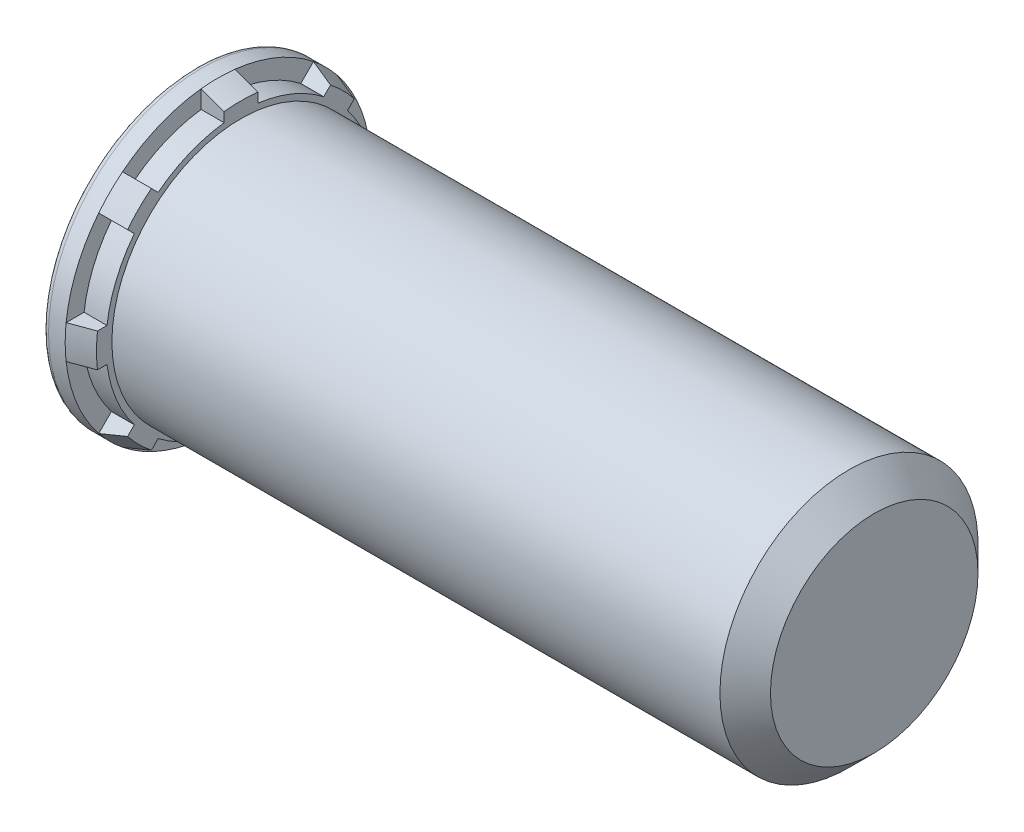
ISO-10303-21;
HEADER;
FILE_DESCRIPTION(('STEP AP214'),'2;1');
FILE_NAME('part.step','',(''),(''),'','','');
FILE_SCHEMA(('AUTOMOTIVE_DESIGN { 1 0 10303 214 1 1 1 1 }'));
ENDSEC;
DATA;
#1=APPLICATION_CONTEXT('core data for automotive mechanical design processes');
#2=APPLICATION_PROTOCOL_DEFINITION('international standard','automotive_design',2000,#1);
#3=PRODUCT_CONTEXT('',#1,'mechanical');
#4=PRODUCT('Part','Part','',(#3));
#5=PRODUCT_RELATED_PRODUCT_CATEGORY('part','',(#4));
#6=PRODUCT_DEFINITION_FORMATION('','',#4);
#7=PRODUCT_DEFINITION_CONTEXT('part definition',#1,'design');
#8=PRODUCT_DEFINITION('design','',#6,#7);
#9=PRODUCT_DEFINITION_SHAPE('','',#8);
#10=(LENGTH_UNIT() NAMED_UNIT(*) SI_UNIT(.MILLI.,.METRE.));
#11=(NAMED_UNIT(*) PLANE_ANGLE_UNIT() SI_UNIT($,.RADIAN.));
#12=(NAMED_UNIT(*) SI_UNIT($,.STERADIAN.) SOLID_ANGLE_UNIT());
#13=UNCERTAINTY_MEASURE_WITH_UNIT(LENGTH_MEASURE(1.E-05),#10,'distance_accuracy_value','');
#14=(GEOMETRIC_REPRESENTATION_CONTEXT(3) GLOBAL_UNCERTAINTY_ASSIGNED_CONTEXT((#13)) GLOBAL_UNIT_ASSIGNED_CONTEXT((#10,
#11,#12)) REPRESENTATION_CONTEXT('',''));
#15=CARTESIAN_POINT('',(0.,0.,0.));
#16=DIRECTION('',(0.,0.,1.));
#17=DIRECTION('',(1.,0.,0.));
#18=AXIS2_PLACEMENT_3D('',#15,#16,#17);
#19=CARTESIAN_POINT('',(0.,0.,0.));
#20=DIRECTION('',(-1.,0.,0.));
#21=DIRECTION('',(0.,0.,1.));
#22=AXIS2_PLACEMENT_3D('',#19,#20,#21);
#23=CONICAL_SURFACE('',#22,2.8575,0.349065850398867);
#24=CARTESIAN_POINT('',(0.428824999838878,1.67445523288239,2.11987551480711));
#25=CARTESIAN_POINT('',(0.357323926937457,1.69298332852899,2.13840361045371));
#26=CARTESIAN_POINT('',(0.285821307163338,1.71150843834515,2.15692872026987));
#27=CARTESIAN_POINT('',(0.142812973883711,1.74855268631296,2.19397296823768));
#28=CARTESIAN_POINT('',(0.0713072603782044,1.76707182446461,2.21249210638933));
#29=CARTESIAN_POINT('',(-0.000199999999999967,1.78558797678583,2.23100825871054));
#30=B_SPLINE_CURVE_WITH_KNOTS('',3,(#24,#25,#26,#27,#28,#29),.UNSPECIFIED.,.F.,.F.,(4,2,4),(0.,
0.228453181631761,0.456906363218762),.UNSPECIFIED.);
#31=CARTESIAN_POINT('',(0.428624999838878,1.67450705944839,2.11992734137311));
#32=VERTEX_POINT('',#31);
#33=CARTESIAN_POINT('',(0.,1.7855361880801,2.23095647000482));
#34=VERTEX_POINT('',#33);
#35=EDGE_CURVE('E271',#32,#34,#30,.T.);
#36=ORIENTED_EDGE('',*,*,#35,.F.);
#37=CARTESIAN_POINT('',(0.428625,0.,0.));
#38=DIRECTION('',(-1.,0.,0.));
#39=DIRECTION('',(0.,0.,1.));
#40=AXIS2_PLACEMENT_3D('',#37,#38,#39);
#41=CIRCLE('',#40,2.70149325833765);
#42=CARTESIAN_POINT('',(0.428624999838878,2.1199273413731,1.6745070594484));
#43=VERTEX_POINT('',#42);
#44=EDGE_CURVE('E322',#32,#43,#41,.T.);
#45=ORIENTED_EDGE('',*,*,#44,.T.);
#46=CARTESIAN_POINT('',(-0.000200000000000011,2.23100825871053,1.78558797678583));
#47=CARTESIAN_POINT('',(0.0713072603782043,2.21249210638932,1.76707182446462));
#48=CARTESIAN_POINT('',(0.142812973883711,2.19397296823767,1.74855268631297));
#49=CARTESIAN_POINT('',(0.285821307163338,2.15692872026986,1.71150843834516));
#50=CARTESIAN_POINT('',(0.357323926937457,2.1384036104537,1.692983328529));
#51=CARTESIAN_POINT('',(0.428824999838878,2.1198755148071,1.6744552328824));
#52=B_SPLINE_CURVE_WITH_KNOTS('',3,(#46,#47,#48,#49,#50,#51),.UNSPECIFIED.,.F.,.F.,(4,2,4),(0.,
0.228453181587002,0.456906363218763),.UNSPECIFIED.);
#53=CARTESIAN_POINT('',(-1.61121550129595E-10,2.23095647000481,1.78553618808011));
#54=VERTEX_POINT('',#53);
#55=EDGE_CURVE('E496',#54,#43,#52,.T.);
#56=ORIENTED_EDGE('',*,*,#55,.F.);
#57=CARTESIAN_POINT('',(0.,0.,0.));
#58=DIRECTION('',(-1.,0.,0.));
#59=DIRECTION('',(0.,0.,1.));
#60=AXIS2_PLACEMENT_3D('',#57,#58,#59);
#61=CIRCLE('',#60,2.8575);
#62=EDGE_CURVE('E280',#34,#54,#61,.T.);
#63=ORIENTED_EDGE('',*,*,#62,.F.);
#64=EDGE_LOOP('',(#36,#45,#56,#63));
#65=FACE_BOUND('',#64,.T.);
#66=ADVANCED_FACE('F33',(#65),#23,.T.);
#67=CARTESIAN_POINT('',(-0.890575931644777,0.314959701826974,3.1660153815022));
#68=CARTESIAN_POINT('',(-0.568904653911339,0.314959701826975,3.04837944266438));
#69=CARTESIAN_POINT('',(-0.247263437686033,0.314959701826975,2.93066143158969));
#70=CARTESIAN_POINT('',(0.395958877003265,0.314959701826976,2.69506126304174));
#71=CARTESIAN_POINT('',(0.717539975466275,0.314959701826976,2.5771791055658));
#72=CARTESIAN_POINT('',(1.03909101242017,0.314959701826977,2.4592148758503));
#73=B_SPLINE_CURVE_WITH_KNOTS('',3,(#67,#68,#69,#70,#71,#72),.UNSPECIFIED.,.F.,.F.,(4,2,4),(0.,
1.02751906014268,2.05503813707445),.UNSPECIFIED.);
#74=CARTESIAN_POINT('',(-1.61121550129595E-10,0.314959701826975,2.84008919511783));
#75=VERTEX_POINT('',#74);
#76=CARTESIAN_POINT('',(0.428624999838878,0.314959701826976,2.6830702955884));
#77=VERTEX_POINT('',#76);
#78=EDGE_CURVE('E248',#75,#77,#73,.T.);
#79=ORIENTED_EDGE('',*,*,#78,.F.);
#80=CARTESIAN_POINT('',(0.,-0.314959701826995,2.84008919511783));
#81=VERTEX_POINT('',#80);
#82=EDGE_CURVE('E267',#81,#75,#61,.T.);
#83=ORIENTED_EDGE('',*,*,#82,.F.);
#84=CARTESIAN_POINT('',(1.03909101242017,-0.314959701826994,2.4592148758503));
#85=CARTESIAN_POINT('',(0.717539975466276,-0.314959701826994,2.5771791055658));
#86=CARTESIAN_POINT('',(0.395958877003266,-0.314959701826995,2.69506126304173));
#87=CARTESIAN_POINT('',(-0.247263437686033,-0.314959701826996,2.93066143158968));
#88=CARTESIAN_POINT('',(-0.568904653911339,-0.314959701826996,3.04837944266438));
#89=CARTESIAN_POINT('',(-0.890575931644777,-0.314959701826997,3.16601538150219));
#90=B_SPLINE_CURVE_WITH_KNOTS('',3,(#84,#85,#86,#87,#88,#89),.UNSPECIFIED.,.F.,.F.,(4,2,4),(0.,
1.02751907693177,2.05503813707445),.UNSPECIFIED.);
#91=CARTESIAN_POINT('',(0.428624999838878,-0.314959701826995,2.6830702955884));
#92=VERTEX_POINT('',#91);
#93=EDGE_CURVE('E272',#92,#81,#90,.T.);
#94=ORIENTED_EDGE('',*,*,#93,.F.);
#95=EDGE_CURVE('E270',#92,#77,#41,.T.);
#96=ORIENTED_EDGE('',*,*,#95,.T.);
#97=EDGE_LOOP('',(#79,#83,#94,#96));
#98=FACE_BOUND('',#97,.T.);
#99=ADVANCED_FACE('F265',(#98),#23,.T.);
#100=CARTESIAN_POINT('',(-0.000200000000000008,-1.78558797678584,2.23100825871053));
#101=CARTESIAN_POINT('',(0.0713072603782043,-1.76707182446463,2.21249210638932));
#102=CARTESIAN_POINT('',(0.142812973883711,-1.74855268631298,2.19397296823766));
#103=CARTESIAN_POINT('',(0.285821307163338,-1.71150843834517,2.15692872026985));
#104=CARTESIAN_POINT('',(0.357323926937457,-1.69298332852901,2.1384036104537));
#105=CARTESIAN_POINT('',(0.428824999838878,-1.67445523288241,2.1198755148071));
#106=B_SPLINE_CURVE_WITH_KNOTS('',3,(#100,#101,#102,#103,#104,#105),.UNSPECIFIED.,.F.,.F.,(4,2,
4),(0.,0.228453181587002,0.456906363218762),.UNSPECIFIED.);
#107=CARTESIAN_POINT('',(-1.61121550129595E-10,-1.78553618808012,2.23095647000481));
#108=VERTEX_POINT('',#107);
#109=CARTESIAN_POINT('',(0.428624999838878,-1.67450705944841,2.1199273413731));
#110=VERTEX_POINT('',#109);
#111=EDGE_CURVE('E340',#108,#110,#106,.T.);
#112=ORIENTED_EDGE('',*,*,#111,.F.);
#113=CARTESIAN_POINT('',(0.,-2.23095647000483,1.7855361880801));
#114=VERTEX_POINT('',#113);
#115=EDGE_CURVE('E279',#114,#108,#61,.T.);
#116=ORIENTED_EDGE('',*,*,#115,.F.);
#117=CARTESIAN_POINT('',(0.428824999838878,-2.11987551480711,1.67445523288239));
#118=CARTESIAN_POINT('',(0.357323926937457,-2.13840361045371,1.69298332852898));
#119=CARTESIAN_POINT('',(0.285821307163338,-2.15692872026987,1.71150843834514));
#120=CARTESIAN_POINT('',(0.142812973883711,-2.19397296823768,1.74855268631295));
#121=CARTESIAN_POINT('',(0.0713072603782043,-2.21249210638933,1.7670718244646));
#122=CARTESIAN_POINT('',(-0.000199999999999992,-2.23100825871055,1.78558797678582));
#123=B_SPLINE_CURVE_WITH_KNOTS('',3,(#117,#118,#119,#120,#121,#122),.UNSPECIFIED.,.F.,.F.,(4,2,
4),(0.,0.228453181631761,0.456906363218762),.UNSPECIFIED.);
#124=CARTESIAN_POINT('',(0.428624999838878,-2.11992734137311,1.67450705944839));
#125=VERTEX_POINT('',#124);
#126=EDGE_CURVE('E611',#125,#114,#123,.T.);
#127=ORIENTED_EDGE('',*,*,#126,.F.);
#128=EDGE_CURVE('E585',#125,#110,#41,.T.);
#129=ORIENTED_EDGE('',*,*,#128,.T.);
#130=EDGE_LOOP('',(#112,#116,#127,#129));
#131=FACE_BOUND('',#130,.T.);
#132=ADVANCED_FACE('F573',(#131),#23,.T.);
#133=CARTESIAN_POINT('',(-0.890575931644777,-3.1660153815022,0.314959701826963));
#134=CARTESIAN_POINT('',(-0.568904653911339,-3.04837944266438,0.314959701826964));
#135=CARTESIAN_POINT('',(-0.247263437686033,-2.93066143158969,0.314959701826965));
#136=CARTESIAN_POINT('',(0.395958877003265,-2.69506126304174,0.314959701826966));
#137=CARTESIAN_POINT('',(0.717539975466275,-2.5771791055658,0.314959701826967));
#138=CARTESIAN_POINT('',(1.03909101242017,-2.4592148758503,0.314959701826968));
#139=B_SPLINE_CURVE_WITH_KNOTS('',3,(#133,#134,#135,#136,#137,#138),.UNSPECIFIED.,.F.,.F.,(4,2,
4),(0.,1.02751906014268,2.05503813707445),.UNSPECIFIED.);
#140=CARTESIAN_POINT('',(-1.61121550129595E-10,-2.84008919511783,0.314959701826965));
#141=VERTEX_POINT('',#140);
#142=CARTESIAN_POINT('',(0.428624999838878,-2.6830702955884,0.314959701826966));
#143=VERTEX_POINT('',#142);
#144=EDGE_CURVE('E623',#141,#143,#139,.T.);
#145=ORIENTED_EDGE('',*,*,#144,.F.);
#146=CARTESIAN_POINT('',(0.,-2.84008919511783,-0.314959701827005));
#147=VERTEX_POINT('',#146);
#148=EDGE_CURVE('E282',#147,#141,#61,.T.);
#149=ORIENTED_EDGE('',*,*,#148,.F.);
#150=CARTESIAN_POINT('',(1.03909101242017,-2.4592148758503,-0.314959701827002));
#151=CARTESIAN_POINT('',(0.717539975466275,-2.5771791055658,-0.314959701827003));
#152=CARTESIAN_POINT('',(0.395958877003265,-2.69506126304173,-0.314959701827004));
#153=CARTESIAN_POINT('',(-0.247263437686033,-2.93066143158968,-0.314959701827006));
#154=CARTESIAN_POINT('',(-0.56890465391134,-3.04837944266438,-0.314959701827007));
#155=CARTESIAN_POINT('',(-0.890575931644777,-3.16601538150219,-0.314959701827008));
#156=B_SPLINE_CURVE_WITH_KNOTS('',3,(#150,#151,#152,#153,#154,#155),.UNSPECIFIED.,.F.,.F.,(4,2,
4),(0.,1.02751907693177,2.05503813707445),.UNSPECIFIED.);
#157=CARTESIAN_POINT('',(0.428624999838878,-2.6830702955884,-0.314959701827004));
#158=VERTEX_POINT('',#157);
#159=EDGE_CURVE('E631',#158,#147,#156,.T.);
#160=ORIENTED_EDGE('',*,*,#159,.F.);
#161=EDGE_CURVE('E597',#158,#143,#41,.T.);
#162=ORIENTED_EDGE('',*,*,#161,.T.);
#163=EDGE_LOOP('',(#145,#149,#160,#162));
#164=FACE_BOUND('',#163,.T.);
#165=ADVANCED_FACE('F633',(#164),#23,.T.);
#166=CARTESIAN_POINT('',(-0.000200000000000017,-2.23100825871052,-1.78558797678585));
#167=CARTESIAN_POINT('',(0.0713072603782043,-2.21249210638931,-1.76707182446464));
#168=CARTESIAN_POINT('',(0.142812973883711,-2.19397296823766,-1.74855268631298));
#169=CARTESIAN_POINT('',(0.285821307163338,-2.15692872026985,-1.71150843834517));
#170=CARTESIAN_POINT('',(0.357323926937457,-2.13840361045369,-1.69298332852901));
#171=CARTESIAN_POINT('',(0.428824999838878,-2.11987551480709,-1.67445523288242));
#172=B_SPLINE_CURVE_WITH_KNOTS('',3,(#166,#167,#168,#169,#170,#171),.UNSPECIFIED.,.F.,.F.,(4,2,
4),(0.,0.228453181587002,0.456906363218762),.UNSPECIFIED.);
#173=CARTESIAN_POINT('',(-1.61121550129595E-10,-2.2309564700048,-1.78553618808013));
#174=VERTEX_POINT('',#173);
#175=CARTESIAN_POINT('',(0.428624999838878,-2.11992734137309,-1.67450705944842));
#176=VERTEX_POINT('',#175);
#177=EDGE_CURVE('E636',#174,#176,#172,.T.);
#178=ORIENTED_EDGE('',*,*,#177,.F.);
#179=CARTESIAN_POINT('',(0.,-1.78553618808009,-2.23095647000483));
#180=VERTEX_POINT('',#179);
#181=EDGE_CURVE('E715',#180,#174,#61,.T.);
#182=ORIENTED_EDGE('',*,*,#181,.F.);
#183=CARTESIAN_POINT('',(0.428824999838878,-1.67445523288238,-2.11987551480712));
#184=CARTESIAN_POINT('',(0.357323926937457,-1.69298332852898,-2.13840361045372));
#185=CARTESIAN_POINT('',(0.285821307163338,-1.71150843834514,-2.15692872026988));
#186=CARTESIAN_POINT('',(0.142812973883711,-1.74855268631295,-2.19397296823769));
#187=CARTESIAN_POINT('',(0.0713072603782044,-1.7670718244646,-2.21249210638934));
#188=CARTESIAN_POINT('',(-0.000199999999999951,-1.78558797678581,-2.23100825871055));
#189=B_SPLINE_CURVE_WITH_KNOTS('',3,(#183,#184,#185,#186,#187,#188),.UNSPECIFIED.,.F.,.F.,(4,2,
4),(0.,0.228453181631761,0.456906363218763),.UNSPECIFIED.);
#190=CARTESIAN_POINT('',(0.428624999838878,-1.67450705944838,-2.11992734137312));
#191=VERTEX_POINT('',#190);
#192=EDGE_CURVE('E639',#191,#180,#189,.T.);
#193=ORIENTED_EDGE('',*,*,#192,.F.);
#194=EDGE_CURVE('E591',#191,#176,#41,.T.);
#195=ORIENTED_EDGE('',*,*,#194,.T.);
#196=EDGE_LOOP('',(#178,#182,#193,#195));
#197=FACE_BOUND('',#196,.T.);
#198=ADVANCED_FACE('F1029',(#197),#23,.T.);
#199=CARTESIAN_POINT('',(-0.890575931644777,-0.314959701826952,-3.1660153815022));
#200=CARTESIAN_POINT('',(-0.568904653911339,-0.314959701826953,-3.04837944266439));
#201=CARTESIAN_POINT('',(-0.247263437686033,-0.314959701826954,-2.93066143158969));
#202=CARTESIAN_POINT('',(0.395958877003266,-0.314959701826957,-2.69506126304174));
#203=CARTESIAN_POINT('',(0.717539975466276,-0.314959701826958,-2.5771791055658));
#204=CARTESIAN_POINT('',(1.03909101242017,-0.314959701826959,-2.4592148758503));
#205=B_SPLINE_CURVE_WITH_KNOTS('',3,(#199,#200,#201,#202,#203,#204),.UNSPECIFIED.,.F.,.F.,(4,2,
4),(0.,1.02751906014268,2.05503813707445),.UNSPECIFIED.);
#206=CARTESIAN_POINT('',(-1.61121550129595E-10,-0.314959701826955,-2.84008919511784));
#207=VERTEX_POINT('',#206);
#208=CARTESIAN_POINT('',(0.428624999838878,-0.314959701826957,-2.6830702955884));
#209=VERTEX_POINT('',#208);
#210=EDGE_CURVE('E688',#207,#209,#205,.T.);
#211=ORIENTED_EDGE('',*,*,#210,.F.);
#212=CARTESIAN_POINT('',(0.,0.314959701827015,-2.84008919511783));
#213=VERTEX_POINT('',#212);
#214=EDGE_CURVE('E711',#213,#207,#61,.T.);
#215=ORIENTED_EDGE('',*,*,#214,.F.);
#216=CARTESIAN_POINT('',(1.03909101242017,0.314959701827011,-2.45921487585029));
#217=CARTESIAN_POINT('',(0.717539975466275,0.314959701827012,-2.5771791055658));
#218=CARTESIAN_POINT('',(0.395958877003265,0.314959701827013,-2.69506126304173));
#219=CARTESIAN_POINT('',(-0.247263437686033,0.314959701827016,-2.93066143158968));
#220=CARTESIAN_POINT('',(-0.568904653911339,0.314959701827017,-3.04837944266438));
#221=CARTESIAN_POINT('',(-0.890575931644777,0.314959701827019,-3.16601538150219));
#222=B_SPLINE_CURVE_WITH_KNOTS('',3,(#216,#217,#218,#219,#220,#221),.UNSPECIFIED.,.F.,.F.,(4,2,
4),(0.,1.02751907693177,2.05503813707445),.UNSPECIFIED.);
#223=CARTESIAN_POINT('',(0.428624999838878,0.314959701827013,-2.6830702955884));
#224=VERTEX_POINT('',#223);
#225=EDGE_CURVE('E456',#224,#213,#222,.T.);
#226=ORIENTED_EDGE('',*,*,#225,.F.);
#227=EDGE_CURVE('E321',#224,#209,#41,.T.);
#228=ORIENTED_EDGE('',*,*,#227,.T.);
#229=EDGE_LOOP('',(#211,#215,#226,#228));
#230=FACE_BOUND('',#229,.T.);
#231=ADVANCED_FACE('F713',(#230),#23,.T.);
#232=CARTESIAN_POINT('',(1.03909101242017,2.4592148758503,0.314959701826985));
#233=CARTESIAN_POINT('',(0.717539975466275,2.5771791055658,0.314959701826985));
#234=CARTESIAN_POINT('',(0.395958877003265,2.69506126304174,0.314959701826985));
#235=CARTESIAN_POINT('',(-0.247263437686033,2.93066143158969,0.314959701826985));
#236=CARTESIAN_POINT('',(-0.568904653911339,3.04837944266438,0.314959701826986));
#237=CARTESIAN_POINT('',(-0.890575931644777,3.16601538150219,0.314959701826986));
#238=B_SPLINE_CURVE_WITH_KNOTS('',3,(#232,#233,#234,#235,#236,#237),.UNSPECIFIED.,.F.,.F.,(4,2,
4),(0.,1.02751907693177,2.05503813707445),.UNSPECIFIED.);
#239=CARTESIAN_POINT('',(0.428624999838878,2.6830702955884,0.314959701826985));
#240=VERTEX_POINT('',#239);
#241=CARTESIAN_POINT('',(0.,2.84008919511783,0.314959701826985));
#242=VERTEX_POINT('',#241);
#243=EDGE_CURVE('E487',#240,#242,#238,.T.);
#244=ORIENTED_EDGE('',*,*,#243,.F.);
#245=CARTESIAN_POINT('',(0.428624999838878,2.6830702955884,-0.314959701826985));
#246=VERTEX_POINT('',#245);
#247=EDGE_CURVE('E316',#240,#246,#41,.T.);
#248=ORIENTED_EDGE('',*,*,#247,.T.);
#249=CARTESIAN_POINT('',(-0.890575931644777,3.16601538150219,-0.314959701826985));
#250=CARTESIAN_POINT('',(-0.568904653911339,3.04837944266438,-0.314959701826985));
#251=CARTESIAN_POINT('',(-0.247263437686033,2.93066143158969,-0.314959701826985));
#252=CARTESIAN_POINT('',(0.395958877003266,2.69506126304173,-0.314959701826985));
#253=CARTESIAN_POINT('',(0.717539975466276,2.5771791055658,-0.314959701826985));
#254=CARTESIAN_POINT('',(1.03909101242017,2.4592148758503,-0.314959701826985));
#255=B_SPLINE_CURVE_WITH_KNOTS('',3,(#249,#250,#251,#252,#253,#254),.UNSPECIFIED.,.F.,.F.,(4,2,
4),(0.,1.02751906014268,2.05503813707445),.UNSPECIFIED.);
#256=CARTESIAN_POINT('',(-1.61121550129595E-10,2.84008919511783,-0.314959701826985));
#257=VERTEX_POINT('',#256);
#258=EDGE_CURVE('E517',#257,#246,#255,.T.);
#259=ORIENTED_EDGE('',*,*,#258,.F.);
#260=EDGE_CURVE('E283',#242,#257,#61,.T.);
#261=ORIENTED_EDGE('',*,*,#260,.F.);
#262=EDGE_LOOP('',(#244,#248,#259,#261));
#263=FACE_BOUND('',#262,.T.);
#264=ADVANCED_FACE('F566',(#263),#23,.T.);
#265=CARTESIAN_POINT('',(-0.000200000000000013,1.78558797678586,-2.23100825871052));
#266=CARTESIAN_POINT('',(0.0713072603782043,1.76707182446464,-2.2124921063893));
#267=CARTESIAN_POINT('',(0.142812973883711,1.74855268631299,-2.19397296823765));
#268=CARTESIAN_POINT('',(0.285821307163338,1.71150843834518,-2.15692872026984));
#269=CARTESIAN_POINT('',(0.357323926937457,1.69298332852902,-2.13840361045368));
#270=CARTESIAN_POINT('',(0.428824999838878,1.67445523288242,-2.11987551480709));
#271=B_SPLINE_CURVE_WITH_KNOTS('',3,(#265,#266,#267,#268,#269,#270),.UNSPECIFIED.,.F.,.F.,(4,2,
4),(0.,0.228453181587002,0.456906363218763),.UNSPECIFIED.);
#272=CARTESIAN_POINT('',(-1.61121550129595E-10,1.78553618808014,-2.2309564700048));
#273=VERTEX_POINT('',#272);
#274=CARTESIAN_POINT('',(0.428624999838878,1.67450705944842,-2.11992734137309));
#275=VERTEX_POINT('',#274);
#276=EDGE_CURVE('E449',#273,#275,#271,.T.);
#277=ORIENTED_EDGE('',*,*,#276,.F.);
#278=CARTESIAN_POINT('',(0.,2.23095647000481,-1.78553618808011));
#279=VERTEX_POINT('',#278);
#280=EDGE_CURVE('E288',#279,#273,#61,.T.);
#281=ORIENTED_EDGE('',*,*,#280,.F.);
#282=CARTESIAN_POINT('',(0.428824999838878,2.1198755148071,-1.6744552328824));
#283=CARTESIAN_POINT('',(0.357323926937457,2.1384036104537,-1.692983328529));
#284=CARTESIAN_POINT('',(0.285821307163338,2.15692872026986,-1.71150843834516));
#285=CARTESIAN_POINT('',(0.142812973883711,2.19397296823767,-1.74855268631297));
#286=CARTESIAN_POINT('',(0.0713072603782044,2.21249210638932,-1.76707182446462));
#287=CARTESIAN_POINT('',(-0.000199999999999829,2.23100825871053,-1.78558797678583));
#288=B_SPLINE_CURVE_WITH_KNOTS('',3,(#282,#283,#284,#285,#286,#287),.UNSPECIFIED.,.F.,.F.,(4,2,
4),(0.,0.228453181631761,0.456906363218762),.UNSPECIFIED.);
#289=CARTESIAN_POINT('',(0.428624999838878,2.1199273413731,-1.6745070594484));
#290=VERTEX_POINT('',#289);
#291=EDGE_CURVE('E289',#290,#279,#288,.T.);
#292=ORIENTED_EDGE('',*,*,#291,.F.);
#293=EDGE_CURVE('E317',#290,#275,#41,.T.);
#294=ORIENTED_EDGE('',*,*,#293,.T.);
#295=EDGE_LOOP('',(#277,#281,#292,#294));
#296=FACE_BOUND('',#295,.T.);
#297=ADVANCED_FACE('F35',(#296),#23,.T.);
#298=CARTESIAN_POINT('',(0.428625,2.70149325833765,0.));
#299=DIRECTION('',(1.,0.,0.));
#300=DIRECTION('',(0.,0.,-1.));
#301=AXIS2_PLACEMENT_3D('',#298,#299,#300);
#302=PLANE('',#301);
#303=DIRECTION('',(0.,0.707106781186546,0.707106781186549));
#304=VECTOR('',#303,1.);
#305=CARTESIAN_POINT('',(0.428624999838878,1.54816639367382,1.99358667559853));
#306=LINE('',#305,#304);
#307=CARTESIAN_POINT('',(0.428624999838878,1.54816639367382,1.99358667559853));
#308=VERTEX_POINT('',#307);
#309=EDGE_CURVE('E260',#308,#32,#306,.T.);
#310=ORIENTED_EDGE('',*,*,#309,.F.);
#311=CARTESIAN_POINT('',(0.428624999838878,0.,0.));
#312=DIRECTION('',(-1.,0.,0.));
#313=DIRECTION('',(0.,1.,0.));
#314=AXIS2_PLACEMENT_3D('',#311,#312,#313);
#315=CIRCLE('',#314,2.524125);
#316=CARTESIAN_POINT('',(0.428624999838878,0.314959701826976,2.50439761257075));
#317=VERTEX_POINT('',#316);
#318=EDGE_CURVE('E366',#317,#308,#315,.T.);
#319=ORIENTED_EDGE('',*,*,#318,.F.);
#320=DIRECTION('',(0.,0.,-1.));
#321=VECTOR('',#320,1.);
#322=CARTESIAN_POINT('',(0.428625,0.314959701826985,0.));
#323=LINE('',#322,#321);
#324=EDGE_CURVE('E11',#77,#317,#323,.T.);
#325=ORIENTED_EDGE('',*,*,#324,.F.);
#326=ORIENTED_EDGE('',*,*,#95,.F.);
#327=DIRECTION('',(0.,0.,1.));
#328=VECTOR('',#327,1.);
#329=CARTESIAN_POINT('',(0.428624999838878,-0.314959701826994,2.50439761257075));
#330=LINE('',#329,#328);
#331=CARTESIAN_POINT('',(0.428624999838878,-0.314959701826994,2.50439761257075));
#332=VERTEX_POINT('',#331);
#333=EDGE_CURVE('E357',#332,#92,#330,.T.);
#334=ORIENTED_EDGE('',*,*,#333,.F.);
#335=CARTESIAN_POINT('',(0.428624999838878,0.,0.));
#336=DIRECTION('',(-1.,0.,0.));
#337=DIRECTION('',(0.,0.707106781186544,0.707106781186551));
#338=AXIS2_PLACEMENT_3D('',#335,#336,#337);
#339=CIRCLE('',#338,2.524125);
#340=CARTESIAN_POINT('',(0.428624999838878,-1.54816639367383,1.99358667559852));
#341=VERTEX_POINT('',#340);
#342=EDGE_CURVE('E348',#341,#332,#339,.T.);
#343=ORIENTED_EDGE('',*,*,#342,.F.);
#344=DIRECTION('',(0.,0.707106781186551,-0.707106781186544));
#345=VECTOR('',#344,1.);
#346=CARTESIAN_POINT('',(0.428625,1.57345677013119,-1.12803648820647));
#347=LINE('',#346,#345);
#348=EDGE_CURVE('E42',#110,#341,#347,.T.);
#349=ORIENTED_EDGE('',*,*,#348,.F.);
#350=ORIENTED_EDGE('',*,*,#128,.F.);
#351=DIRECTION('',(0.,-0.707106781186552,0.707106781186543));
#352=VECTOR('',#351,1.);
#353=CARTESIAN_POINT('',(0.428624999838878,-1.99358667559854,1.54816639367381));
#354=LINE('',#353,#352);
#355=CARTESIAN_POINT('',(0.428624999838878,-1.99358667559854,1.54816639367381));
#356=VERTEX_POINT('',#355);
#357=EDGE_CURVE('E372',#356,#125,#354,.T.);
#358=ORIENTED_EDGE('',*,*,#357,.F.);
#359=CARTESIAN_POINT('',(0.428624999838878,0.,0.));
#360=DIRECTION('',(-1.,0.,0.));
#361=DIRECTION('',(0.,0.,1.));
#362=AXIS2_PLACEMENT_3D('',#359,#360,#361);
#363=CIRCLE('',#362,2.524125);
#364=CARTESIAN_POINT('',(0.428624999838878,-2.50439761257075,0.314959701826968));
#365=VERTEX_POINT('',#364);
#366=EDGE_CURVE('E380',#365,#356,#363,.T.);
#367=ORIENTED_EDGE('',*,*,#366,.F.);
#368=DIRECTION('',(0.,1.,0.));
#369=VECTOR('',#368,1.);
#370=CARTESIAN_POINT('',(0.428625,2.70149325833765,0.314959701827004));
#371=LINE('',#370,#369);
#372=EDGE_CURVE('E332',#143,#365,#371,.T.);
#373=ORIENTED_EDGE('',*,*,#372,.F.);
#374=ORIENTED_EDGE('',*,*,#161,.F.);
#375=DIRECTION('',(0.,-1.,0.));
#376=VECTOR('',#375,1.);
#377=CARTESIAN_POINT('',(0.428624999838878,-2.50439761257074,-0.314959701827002));
#378=LINE('',#377,#376);
#379=CARTESIAN_POINT('',(0.428624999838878,-2.50439761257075,-0.314959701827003));
#380=VERTEX_POINT('',#379);
#381=EDGE_CURVE('E391',#380,#158,#378,.T.);
#382=ORIENTED_EDGE('',*,*,#381,.F.);
#383=CARTESIAN_POINT('',(0.428624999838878,0.,0.));
#384=DIRECTION('',(-1.,0.,0.));
#385=DIRECTION('',(0.,-0.707106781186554,0.707106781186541));
#386=AXIS2_PLACEMENT_3D('',#383,#384,#385);
#387=CIRCLE('',#386,2.524125);
#388=CARTESIAN_POINT('',(0.428624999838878,-1.99358667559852,-1.54816639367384));
#389=VERTEX_POINT('',#388);
#390=EDGE_CURVE('E400',#389,#380,#387,.T.);
#391=ORIENTED_EDGE('',*,*,#390,.F.);
#392=DIRECTION('',(0.,0.707106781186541,0.707106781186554));
#393=VECTOR('',#392,1.);
#394=CARTESIAN_POINT('',(0.428625,1.12803648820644,1.57345677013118));
#395=LINE('',#394,#393);
#396=EDGE_CURVE('E330',#176,#389,#395,.T.);
#397=ORIENTED_EDGE('',*,*,#396,.F.);
#398=ORIENTED_EDGE('',*,*,#194,.F.);
#399=DIRECTION('',(0.,-0.707106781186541,-0.707106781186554));
#400=VECTOR('',#399,1.);
#401=CARTESIAN_POINT('',(0.428624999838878,-1.5481663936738,-1.99358667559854));
#402=LINE('',#401,#400);
#403=CARTESIAN_POINT('',(0.428624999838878,-1.5481663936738,-1.99358667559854));
#404=VERTEX_POINT('',#403);
#405=EDGE_CURVE('E412',#404,#191,#402,.T.);
#406=ORIENTED_EDGE('',*,*,#405,.F.);
#407=CARTESIAN_POINT('',(0.428624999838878,0.,0.));
#408=DIRECTION('',(-1.,0.,0.));
#409=DIRECTION('',(0.,-1.,0.));
#410=AXIS2_PLACEMENT_3D('',#407,#408,#409);
#411=CIRCLE('',#410,2.524125);
#412=CARTESIAN_POINT('',(0.428624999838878,-0.314959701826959,-2.50439761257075));
#413=VERTEX_POINT('',#412);
#414=EDGE_CURVE('E421',#413,#404,#411,.T.);
#415=ORIENTED_EDGE('',*,*,#414,.F.);
#416=DIRECTION('',(0.,0.,1.));
#417=VECTOR('',#416,1.);
#418=CARTESIAN_POINT('',(0.428625,-0.314959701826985,0.));
#419=LINE('',#418,#417);
#420=EDGE_CURVE('E328',#209,#413,#419,.T.);
#421=ORIENTED_EDGE('',*,*,#420,.F.);
#422=ORIENTED_EDGE('',*,*,#227,.F.);
#423=DIRECTION('',(0.,0.,-1.));
#424=VECTOR('',#423,1.);
#425=CARTESIAN_POINT('',(0.428624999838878,0.314959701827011,-2.50439761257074));
#426=LINE('',#425,#424);
#427=CARTESIAN_POINT('',(0.428624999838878,0.314959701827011,-2.50439761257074));
#428=VERTEX_POINT('',#427);
#429=EDGE_CURVE('E433',#428,#224,#426,.T.);
#430=ORIENTED_EDGE('',*,*,#429,.F.);
#431=CARTESIAN_POINT('',(0.428624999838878,0.,0.));
#432=DIRECTION('',(-1.,0.,0.));
#433=DIRECTION('',(0.,-0.707106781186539,-0.707106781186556));
#434=AXIS2_PLACEMENT_3D('',#431,#432,#433);
#435=CIRCLE('',#434,2.524125);
#436=CARTESIAN_POINT('',(0.428624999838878,1.54816639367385,-1.99358667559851));
#437=VERTEX_POINT('',#436);
#438=EDGE_CURVE('E442',#437,#428,#435,.T.);
#439=ORIENTED_EDGE('',*,*,#438,.F.);
#440=DIRECTION('',(0.,-0.707106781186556,0.707106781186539));
#441=VECTOR('',#440,1.);
#442=CARTESIAN_POINT('',(0.428625,1.12803648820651,-1.57345677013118));
#443=LINE('',#442,#441);
#444=EDGE_CURVE('E326',#275,#437,#443,.T.);
#445=ORIENTED_EDGE('',*,*,#444,.F.);
#446=ORIENTED_EDGE('',*,*,#293,.F.);
#447=DIRECTION('',(0.,0.707106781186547,-0.707106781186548));
#448=VECTOR('',#447,1.);
#449=CARTESIAN_POINT('',(0.428624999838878,1.99358667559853,-1.54816639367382));
#450=LINE('',#449,#448);
#451=CARTESIAN_POINT('',(0.428624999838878,1.99358667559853,-1.54816639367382));
#452=VERTEX_POINT('',#451);
#453=EDGE_CURVE('E506',#452,#290,#450,.T.);
#454=ORIENTED_EDGE('',*,*,#453,.F.);
#455=CARTESIAN_POINT('',(0.428624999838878,0.,0.));
#456=DIRECTION('',(-1.,0.,0.));
#457=DIRECTION('',(0.,0.,-1.));
#458=AXIS2_PLACEMENT_3D('',#455,#456,#457);
#459=CIRCLE('',#458,2.524125);
#460=CARTESIAN_POINT('',(0.428624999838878,2.50439761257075,-0.314959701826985));
#461=VERTEX_POINT('',#460);
#462=EDGE_CURVE('E495',#461,#452,#459,.T.);
#463=ORIENTED_EDGE('',*,*,#462,.F.);
#464=DIRECTION('',(0.,-1.,0.));
#465=VECTOR('',#464,1.);
#466=CARTESIAN_POINT('',(0.428625,2.70149325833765,-0.314959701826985));
#467=LINE('',#466,#465);
#468=EDGE_CURVE('E320',#246,#461,#467,.T.);
#469=ORIENTED_EDGE('',*,*,#468,.F.);
#470=ORIENTED_EDGE('',*,*,#247,.F.);
#471=DIRECTION('',(0.,1.,0.));
#472=VECTOR('',#471,1.);
#473=CARTESIAN_POINT('',(0.428624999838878,2.50439761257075,0.314959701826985));
#474=LINE('',#473,#472);
#475=CARTESIAN_POINT('',(0.428624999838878,2.50439761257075,0.314959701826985));
#476=VERTEX_POINT('',#475);
#477=EDGE_CURVE('E815',#476,#240,#474,.T.);
#478=ORIENTED_EDGE('',*,*,#477,.F.);
#479=CARTESIAN_POINT('',(0.428624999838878,0.,0.));
#480=DIRECTION('',(-1.,0.,0.));
#481=DIRECTION('',(0.,0.707106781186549,-0.707106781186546));
#482=AXIS2_PLACEMENT_3D('',#479,#480,#481);
#483=CIRCLE('',#482,2.524125);
#484=CARTESIAN_POINT('',(0.428624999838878,1.99358667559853,1.54816639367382));
#485=VERTEX_POINT('',#484);
#486=EDGE_CURVE('E580',#485,#476,#483,.T.);
#487=ORIENTED_EDGE('',*,*,#486,.F.);
#488=DIRECTION('',(0.,-0.707106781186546,-0.707106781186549));
#489=VECTOR('',#488,1.);
#490=CARTESIAN_POINT('',(0.428625,1.57345677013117,1.12803648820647));
#491=LINE('',#490,#489);
#492=EDGE_CURVE('E324',#43,#485,#491,.T.);
#493=ORIENTED_EDGE('',*,*,#492,.F.);
#494=ORIENTED_EDGE('',*,*,#44,.F.);
#495=EDGE_LOOP('',(#310,#319,#325,#326,#334,#343,#349,#350,#358,#367,#373,#374,#382,#391,#397,
#398,#406,#415,#421,#422,#430,#439,#445,#446,#454,#463,#469,#470,#478,#487,#493,#494));
#496=FACE_BOUND('',#495,.T.);
#497=CARTESIAN_POINT('',(0.428625,0.,0.));
#498=DIRECTION('',(-1.,0.,0.));
#499=DIRECTION('',(0.,0.,1.));
#500=AXIS2_PLACEMENT_3D('',#497,#498,#499);
#501=CIRCLE('',#500,2.413);
#502=CARTESIAN_POINT('',(0.428625,0.,2.413));
#503=VERTEX_POINT('',#502);
#504=EDGE_CURVE('E313',#503,#503,#501,.T.);
#505=ORIENTED_EDGE('',*,*,#504,.T.);
#506=EDGE_LOOP('',(#505));
#507=FACE_BOUND('',#506,.T.);
#508=ADVANCED_FACE('F355',(#496,#507),#302,.T.);
#509=CARTESIAN_POINT('',(0.,0.,0.));
#510=DIRECTION('',(-1.,0.,0.));
#511=DIRECTION('',(0.,0.,1.));
#512=AXIS2_PLACEMENT_3D('',#509,#510,#511);
#513=CYLINDRICAL_SURFACE('',#512,2.413);
#514=CARTESIAN_POINT('',(11.7989349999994,0.,0.));
#515=DIRECTION('',(-1.,0.,0.));
#516=DIRECTION('',(0.,0.,1.));
#517=AXIS2_PLACEMENT_3D('',#514,#515,#516);
#518=CIRCLE('',#517,2.413);
#519=CARTESIAN_POINT('',(11.7989349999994,0.,2.413));
#520=VERTEX_POINT('',#519);
#521=EDGE_CURVE('E310',#520,#520,#518,.T.);
#522=ORIENTED_EDGE('',*,*,#521,.T.);
#523=EDGE_LOOP('',(#522));
#524=FACE_BOUND('',#523,.T.);
#525=ORIENTED_EDGE('',*,*,#504,.F.);
#526=EDGE_LOOP('',(#525));
#527=FACE_BOUND('',#526,.T.);
#528=ADVANCED_FACE('F558',(#524,#527),#513,.T.);
#529=CARTESIAN_POINT('',(12.271375,0.,0.));
#530=DIRECTION('',(-1.,0.,0.));
#531=DIRECTION('',(0.,0.,1.));
#532=AXIS2_PLACEMENT_3D('',#529,#530,#531);
#533=CONICAL_SURFACE('',#532,1.94056,0.785398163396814);
#534=ORIENTED_EDGE('',*,*,#521,.F.);
#535=EDGE_LOOP('',(#534));
#536=FACE_BOUND('',#535,.T.);
#537=CARTESIAN_POINT('',(12.271375,0.,0.));
#538=DIRECTION('',(-1.,0.,0.));
#539=DIRECTION('',(0.,0.,1.));
#540=AXIS2_PLACEMENT_3D('',#537,#538,#539);
#541=CIRCLE('',#540,1.94056);
#542=CARTESIAN_POINT('',(12.271375,0.,1.94056));
#543=VERTEX_POINT('',#542);
#544=EDGE_CURVE('E307',#543,#543,#541,.T.);
#545=ORIENTED_EDGE('',*,*,#544,.T.);
#546=EDGE_LOOP('',(#545));
#547=FACE_BOUND('',#546,.T.);
#548=ADVANCED_FACE('F554',(#536,#547),#533,.T.);
#549=CARTESIAN_POINT('',(12.271375,1.94056,0.));
#550=DIRECTION('',(1.,0.,0.));
#551=DIRECTION('',(0.,0.,-1.));
#552=AXIS2_PLACEMENT_3D('',#549,#550,#551);
#553=PLANE('',#552);
#554=ORIENTED_EDGE('',*,*,#544,.F.);
#555=EDGE_LOOP('',(#554));
#556=FACE_BOUND('',#555,.T.);
#557=ADVANCED_FACE('F550',(#556),#553,.T.);
#558=CARTESIAN_POINT('',(-0.428625,2.74066,0.));
#559=DIRECTION('',(1.,0.,0.));
#560=DIRECTION('',(0.,0.,-1.));
#561=AXIS2_PLACEMENT_3D('',#558,#559,#560);
#562=PLANE('',#561);
#563=CARTESIAN_POINT('',(-0.428625,0.,0.));
#564=DIRECTION('',(-1.,0.,0.));
#565=DIRECTION('',(0.,0.,1.));
#566=AXIS2_PLACEMENT_3D('',#563,#564,#565);
#567=CIRCLE('',#566,2.74066);
#568=CARTESIAN_POINT('',(-0.428625,0.,2.74066));
#569=VERTEX_POINT('',#568);
#570=EDGE_CURVE('E304',#569,#569,#567,.T.);
#571=ORIENTED_EDGE('',*,*,#570,.T.);
#572=EDGE_LOOP('',(#571));
#573=FACE_BOUND('',#572,.T.);
#574=ADVANCED_FACE('F546',(#573),#562,.F.);
#575=CARTESIAN_POINT('',(0.,0.,0.));
#576=DIRECTION('',(-1.,0.,0.));
#577=DIRECTION('',(0.,0.,1.));
#578=AXIS2_PLACEMENT_3D('',#575,#576,#577);
#579=CYLINDRICAL_SURFACE('',#578,2.74066);
#580=CARTESIAN_POINT('',(-0.426085,0.,0.));
#581=DIRECTION('',(-1.,0.,0.));
#582=DIRECTION('',(0.,0.,1.));
#583=AXIS2_PLACEMENT_3D('',#580,#581,#582);
#584=CIRCLE('',#583,2.74066);
#585=CARTESIAN_POINT('',(-0.426085,0.,2.74066));
#586=VERTEX_POINT('',#585);
#587=EDGE_CURVE('E301',#586,#586,#584,.T.);
#588=ORIENTED_EDGE('',*,*,#587,.T.);
#589=EDGE_LOOP('',(#588));
#590=FACE_BOUND('',#589,.T.);
#591=ORIENTED_EDGE('',*,*,#570,.F.);
#592=EDGE_LOOP('',(#591));
#593=FACE_BOUND('',#592,.T.);
#594=ADVANCED_FACE('F542',(#590,#593),#579,.T.);
#595=CARTESIAN_POINT('',(-0.426085,2.74066,0.));
#596=DIRECTION('',(-1.,0.,0.));
#597=DIRECTION('',(0.,0.,1.));
#598=AXIS2_PLACEMENT_3D('',#595,#596,#597);
#599=PLANE('',#598);
#600=CARTESIAN_POINT('',(-0.426085,0.,0.));
#601=DIRECTION('',(-1.,0.,0.));
#602=DIRECTION('',(0.,0.,1.));
#603=AXIS2_PLACEMENT_3D('',#600,#601,#602);
#604=CIRCLE('',#603,2.7432);
#605=CARTESIAN_POINT('',(-0.426085,0.,2.7432));
#606=VERTEX_POINT('',#605);
#607=EDGE_CURVE('E298',#606,#606,#604,.T.);
#608=ORIENTED_EDGE('',*,*,#607,.T.);
#609=EDGE_LOOP('',(#608));
#610=FACE_BOUND('',#609,.T.);
#611=ORIENTED_EDGE('',*,*,#587,.F.);
#612=EDGE_LOOP('',(#611));
#613=FACE_BOUND('',#612,.T.);
#614=ADVANCED_FACE('F538',(#610,#613),#599,.T.);
#615=CARTESIAN_POINT('',(-0.311785,0.,0.));
#616=DIRECTION('',(-1.,0.,0.));
#617=DIRECTION('',(0.,0.,1.));
#618=AXIS2_PLACEMENT_3D('',#615,#616,#617);
#619=TOROIDAL_SURFACE('',#618,2.7432,0.1143);
#620=CARTESIAN_POINT('',(-0.311785,0.,0.));
#621=DIRECTION('',(-1.,0.,0.));
#622=DIRECTION('',(0.,0.,1.));
#623=AXIS2_PLACEMENT_3D('',#620,#621,#622);
#624=CIRCLE('',#623,2.8575);
#625=CARTESIAN_POINT('',(-0.311785,0.,2.8575));
#626=VERTEX_POINT('',#625);
#627=EDGE_CURVE('E287',#626,#626,#624,.T.);
#628=ORIENTED_EDGE('',*,*,#627,.T.);
#629=EDGE_LOOP('',(#628));
#630=FACE_BOUND('',#629,.T.);
#631=ORIENTED_EDGE('',*,*,#607,.F.);
#632=EDGE_LOOP('',(#631));
#633=FACE_BOUND('',#632,.T.);
#634=ADVANCED_FACE('F535',(#630,#633),#619,.T.);
#635=CARTESIAN_POINT('',(0.,0.,0.));
#636=DIRECTION('',(-1.,0.,0.));
#637=DIRECTION('',(0.,0.,1.));
#638=AXIS2_PLACEMENT_3D('',#635,#636,#637);
#639=CYLINDRICAL_SURFACE('',#638,2.8575);
#640=EDGE_CURVE('E284',#257,#279,#61,.T.);
#641=ORIENTED_EDGE('',*,*,#640,.T.);
#642=ORIENTED_EDGE('',*,*,#280,.T.);
#643=CARTESIAN_POINT('',(-1.61121550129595E-10,0.,0.));
#644=DIRECTION('',(1.,0.,0.));
#645=DIRECTION('',(0.,-0.707106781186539,-0.707106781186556));
#646=AXIS2_PLACEMENT_3D('',#643,#644,#645);
#647=CIRCLE('',#646,2.8575);
#648=EDGE_CURVE('E429',#213,#273,#647,.T.);
#649=ORIENTED_EDGE('',*,*,#648,.F.);
#650=ORIENTED_EDGE('',*,*,#214,.T.);
#651=CARTESIAN_POINT('',(-1.61121550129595E-10,0.,0.));
#652=DIRECTION('',(1.,0.,0.));
#653=DIRECTION('',(0.,-1.,0.));
#654=AXIS2_PLACEMENT_3D('',#651,#652,#653);
#655=CIRCLE('',#654,2.8575);
#656=EDGE_CURVE('E408',#180,#207,#655,.T.);
#657=ORIENTED_EDGE('',*,*,#656,.F.);
#658=ORIENTED_EDGE('',*,*,#181,.T.);
#659=CARTESIAN_POINT('',(-1.61121550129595E-10,0.,0.));
#660=DIRECTION('',(1.,0.,0.));
#661=DIRECTION('',(0.,-0.707106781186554,0.707106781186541));
#662=AXIS2_PLACEMENT_3D('',#659,#660,#661);
#663=CIRCLE('',#662,2.8575);
#664=EDGE_CURVE('E387',#147,#174,#663,.T.);
#665=ORIENTED_EDGE('',*,*,#664,.F.);
#666=ORIENTED_EDGE('',*,*,#148,.T.);
#667=CARTESIAN_POINT('',(-1.61121550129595E-10,0.,0.));
#668=DIRECTION('',(1.,0.,0.));
#669=DIRECTION('',(0.,0.,1.));
#670=AXIS2_PLACEMENT_3D('',#667,#668,#669);
#671=CIRCLE('',#670,2.8575);
#672=EDGE_CURVE('E368',#114,#141,#671,.T.);
#673=ORIENTED_EDGE('',*,*,#672,.F.);
#674=ORIENTED_EDGE('',*,*,#115,.T.);
#675=CARTESIAN_POINT('',(-1.61121550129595E-10,0.,0.));
#676=DIRECTION('',(1.,0.,0.));
#677=DIRECTION('',(0.,0.707106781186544,0.707106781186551));
#678=AXIS2_PLACEMENT_3D('',#675,#676,#677);
#679=CIRCLE('',#678,2.8575);
#680=EDGE_CURVE('E278',#81,#108,#679,.T.);
#681=ORIENTED_EDGE('',*,*,#680,.F.);
#682=ORIENTED_EDGE('',*,*,#82,.T.);
#683=CARTESIAN_POINT('',(-1.61121550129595E-10,0.,0.));
#684=DIRECTION('',(1.,0.,0.));
#685=DIRECTION('',(0.,1.,0.));
#686=AXIS2_PLACEMENT_3D('',#683,#684,#685);
#687=CIRCLE('',#686,2.8575);
#688=EDGE_CURVE('E254',#34,#75,#687,.T.);
#689=ORIENTED_EDGE('',*,*,#688,.F.);
#690=ORIENTED_EDGE('',*,*,#62,.T.);
#691=CARTESIAN_POINT('',(-1.61121550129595E-10,0.,0.));
#692=DIRECTION('',(1.,0.,0.));
#693=DIRECTION('',(0.,0.707106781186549,-0.707106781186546));
#694=AXIS2_PLACEMENT_3D('',#691,#692,#693);
#695=CIRCLE('',#694,2.8575);
#696=EDGE_CURVE('E811',#242,#54,#695,.T.);
#697=ORIENTED_EDGE('',*,*,#696,.F.);
#698=ORIENTED_EDGE('',*,*,#260,.T.);
#699=EDGE_LOOP('',(#641,#642,#649,#650,#657,#658,#665,#666,#673,#674,#681,#682,#689,#690,#697,#698));
#700=FACE_BOUND('',#699,.T.);
#701=ORIENTED_EDGE('',*,*,#627,.F.);
#702=EDGE_LOOP('',(#701));
#703=FACE_BOUND('',#702,.T.);
#704=ADVANCED_FACE('F275',(#700,#703),#639,.T.);
#705=CARTESIAN_POINT('',(-1.61121550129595E-10,1.99358667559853,-1.54816639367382));
#706=DIRECTION('',(0.,-0.707106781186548,-0.707106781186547));
#707=DIRECTION('',(0.,0.707106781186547,-0.707106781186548));
#708=AXIS2_PLACEMENT_3D('',#705,#706,#707);
#709=PLANE('',#708);
#710=ORIENTED_EDGE('',*,*,#291,.T.);
#711=DIRECTION('',(0.,0.707106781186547,-0.707106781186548));
#712=VECTOR('',#711,1.);
#713=CARTESIAN_POINT('',(-1.61121550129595E-10,1.99358667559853,-1.54816639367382));
#714=LINE('',#713,#712);
#715=CARTESIAN_POINT('',(-1.61121550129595E-10,1.99358667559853,-1.54816639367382));
#716=VERTEX_POINT('',#715);
#717=EDGE_CURVE('E509',#716,#279,#714,.T.);
#718=ORIENTED_EDGE('',*,*,#717,.F.);
#719=DIRECTION('',(1.,0.,0.));
#720=VECTOR('',#719,1.);
#721=CARTESIAN_POINT('',(-1.61121550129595E-10,1.99358667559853,-1.54816639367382));
#722=LINE('',#721,#720);
#723=EDGE_CURVE('E515',#716,#452,#722,.T.);
#724=ORIENTED_EDGE('',*,*,#723,.T.);
#725=ORIENTED_EDGE('',*,*,#453,.T.);
#726=EDGE_LOOP('',(#710,#718,#724,#725));
#727=FACE_BOUND('',#726,.T.);
#728=ADVANCED_FACE('F534',(#727),#709,.F.);
#729=CARTESIAN_POINT('',(-1.61121550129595E-10,0.,0.));
#730=DIRECTION('',(1.,0.,0.));
#731=DIRECTION('',(0.,0.,-1.));
#732=AXIS2_PLACEMENT_3D('',#729,#730,#731);
#733=CYLINDRICAL_SURFACE('',#732,2.524125);
#734=ORIENTED_EDGE('',*,*,#462,.T.);
#735=ORIENTED_EDGE('',*,*,#723,.F.);
#736=CARTESIAN_POINT('',(-1.61121550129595E-10,0.,0.));
#737=DIRECTION('',(-1.,0.,0.));
#738=DIRECTION('',(0.,0.,-1.));
#739=AXIS2_PLACEMENT_3D('',#736,#737,#738);
#740=CIRCLE('',#739,2.524125);
#741=CARTESIAN_POINT('',(-1.61121550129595E-10,2.50439761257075,-0.314959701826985));
#742=VERTEX_POINT('',#741);
#743=EDGE_CURVE('E505',#742,#716,#740,.T.);
#744=ORIENTED_EDGE('',*,*,#743,.F.);
#745=DIRECTION('',(1.,0.,0.));
#746=VECTOR('',#745,1.);
#747=CARTESIAN_POINT('',(-1.61121550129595E-10,2.50439761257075,-0.314959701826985));
#748=LINE('',#747,#746);
#749=EDGE_CURVE('E511',#742,#461,#748,.T.);
#750=ORIENTED_EDGE('',*,*,#749,.T.);
#751=EDGE_LOOP('',(#734,#735,#744,#750));
#752=FACE_BOUND('',#751,.T.);
#753=ADVANCED_FACE('F530',(#752),#733,.T.);
#754=CARTESIAN_POINT('',(-1.61121550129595E-10,2.50439761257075,-0.314959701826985));
#755=DIRECTION('',(0.,0.,1.));
#756=DIRECTION('',(1.,0.,0.));
#757=AXIS2_PLACEMENT_3D('',#754,#755,#756);
#758=PLANE('',#757);
#759=ORIENTED_EDGE('',*,*,#258,.T.);
#760=ORIENTED_EDGE('',*,*,#468,.T.);
#761=ORIENTED_EDGE('',*,*,#749,.F.);
#762=DIRECTION('',(0.,-1.,0.));
#763=VECTOR('',#762,1.);
#764=CARTESIAN_POINT('',(-1.61121550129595E-10,2.50439761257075,-0.314959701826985));
#765=LINE('',#764,#763);
#766=EDGE_CURVE('E502',#257,#742,#765,.T.);
#767=ORIENTED_EDGE('',*,*,#766,.F.);
#768=EDGE_LOOP('',(#759,#760,#761,#767));
#769=FACE_BOUND('',#768,.T.);
#770=ADVANCED_FACE('F525',(#769),#758,.F.);
#771=CARTESIAN_POINT('',(-1.61121550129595E-10,0.,0.));
#772=DIRECTION('',(1.,0.,0.));
#773=DIRECTION('',(0.,0.,-1.));
#774=AXIS2_PLACEMENT_3D('',#771,#772,#773);
#775=PLANE('',#774);
#776=ORIENTED_EDGE('',*,*,#640,.F.);
#777=ORIENTED_EDGE('',*,*,#766,.T.);
#778=ORIENTED_EDGE('',*,*,#743,.T.);
#779=ORIENTED_EDGE('',*,*,#717,.T.);
#780=EDGE_LOOP('',(#776,#777,#778,#779));
#781=FACE_BOUND('',#780,.T.);
#782=ADVANCED_FACE('F483',(#781),#775,.T.);
#783=CARTESIAN_POINT('',(-1.61121550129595E-10,2.50439761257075,0.314959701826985));
#784=DIRECTION('',(0.,0.,-1.));
#785=DIRECTION('',(0.,1.,0.));
#786=AXIS2_PLACEMENT_3D('',#783,#784,#785);
#787=PLANE('',#786);
#788=ORIENTED_EDGE('',*,*,#243,.T.);
#789=DIRECTION('',(0.,1.,0.));
#790=VECTOR('',#789,1.);
#791=CARTESIAN_POINT('',(-1.61121550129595E-10,2.50439761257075,0.314959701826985));
#792=LINE('',#791,#790);
#793=CARTESIAN_POINT('',(-1.61121550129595E-10,2.50439761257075,0.314959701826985));
#794=VERTEX_POINT('',#793);
#795=EDGE_CURVE('E821',#794,#242,#792,.T.);
#796=ORIENTED_EDGE('',*,*,#795,.F.);
#797=DIRECTION('',(1.,0.,0.));
#798=VECTOR('',#797,1.);
#799=CARTESIAN_POINT('',(-1.61121550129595E-10,2.50439761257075,0.314959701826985));
#800=LINE('',#799,#798);
#801=EDGE_CURVE('E827',#794,#476,#800,.T.);
#802=ORIENTED_EDGE('',*,*,#801,.T.);
#803=ORIENTED_EDGE('',*,*,#477,.T.);
#804=EDGE_LOOP('',(#788,#796,#802,#803));
#805=FACE_BOUND('',#804,.T.);
#806=ADVANCED_FACE('F478',(#805),#787,.F.);
#807=CARTESIAN_POINT('',(-1.61121550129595E-10,0.,0.));
#808=DIRECTION('',(1.,0.,0.));
#809=DIRECTION('',(0.,0.,-1.));
#810=AXIS2_PLACEMENT_3D('',#807,#808,#809);
#811=CYLINDRICAL_SURFACE('',#810,2.524125);
#812=ORIENTED_EDGE('',*,*,#486,.T.);
#813=ORIENTED_EDGE('',*,*,#801,.F.);
#814=CARTESIAN_POINT('',(-1.61121550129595E-10,0.,0.));
#815=DIRECTION('',(-1.,0.,0.));
#816=DIRECTION('',(0.,0.707106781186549,-0.707106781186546));
#817=AXIS2_PLACEMENT_3D('',#814,#815,#816);
#818=CIRCLE('',#817,2.524125);
#819=CARTESIAN_POINT('',(-1.61121550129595E-10,1.99358667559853,1.54816639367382));
#820=VERTEX_POINT('',#819);
#821=EDGE_CURVE('E818',#820,#794,#818,.T.);
#822=ORIENTED_EDGE('',*,*,#821,.F.);
#823=DIRECTION('',(1.,0.,0.));
#824=VECTOR('',#823,1.);
#825=CARTESIAN_POINT('',(-1.61121550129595E-10,1.99358667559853,1.54816639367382));
#826=LINE('',#825,#824);
#827=EDGE_CURVE('E823',#820,#485,#826,.T.);
#828=ORIENTED_EDGE('',*,*,#827,.T.);
#829=EDGE_LOOP('',(#812,#813,#822,#828));
#830=FACE_BOUND('',#829,.T.);
#831=ADVANCED_FACE('F482',(#830),#811,.T.);
#832=CARTESIAN_POINT('',(-1.61121550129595E-10,1.99358667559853,1.54816639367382));
#833=DIRECTION('',(0.,-0.707106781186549,0.707106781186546));
#834=DIRECTION('',(0.,-0.707106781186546,-0.707106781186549));
#835=AXIS2_PLACEMENT_3D('',#832,#833,#834);
#836=PLANE('',#835);
#837=ORIENTED_EDGE('',*,*,#55,.T.);
#838=ORIENTED_EDGE('',*,*,#492,.T.);
#839=ORIENTED_EDGE('',*,*,#827,.F.);
#840=DIRECTION('',(0.,-0.707106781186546,-0.707106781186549));
#841=VECTOR('',#840,1.);
#842=CARTESIAN_POINT('',(-1.61121550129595E-10,1.99358667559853,1.54816639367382));
#843=LINE('',#842,#841);
#844=EDGE_CURVE('E814',#54,#820,#843,.T.);
#845=ORIENTED_EDGE('',*,*,#844,.F.);
#846=EDGE_LOOP('',(#837,#838,#839,#845));
#847=FACE_BOUND('',#846,.T.);
#848=ADVANCED_FACE('F476',(#847),#836,.F.);
#849=CARTESIAN_POINT('',(-1.61121550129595E-10,0.,0.));
#850=DIRECTION('',(1.,0.,0.));
#851=DIRECTION('',(0.,0.707106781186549,-0.707106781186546));
#852=AXIS2_PLACEMENT_3D('',#849,#850,#851);
#853=PLANE('',#852);
#854=ORIENTED_EDGE('',*,*,#696,.T.);
#855=ORIENTED_EDGE('',*,*,#844,.T.);
#856=ORIENTED_EDGE('',*,*,#821,.T.);
#857=ORIENTED_EDGE('',*,*,#795,.T.);
#858=EDGE_LOOP('',(#854,#855,#856,#857));
#859=FACE_BOUND('',#858,.T.);
#860=ADVANCED_FACE('F472',(#859),#853,.T.);
#861=CARTESIAN_POINT('',(-1.61121550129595E-10,0.314959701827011,-2.50439761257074));
#862=DIRECTION('',(0.,-1.,0.));
#863=DIRECTION('',(0.,0.,-1.));
#864=AXIS2_PLACEMENT_3D('',#861,#862,#863);
#865=PLANE('',#864);
#866=ORIENTED_EDGE('',*,*,#225,.T.);
#867=DIRECTION('',(0.,0.,-1.));
#868=VECTOR('',#867,1.);
#869=CARTESIAN_POINT('',(-1.61121550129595E-10,0.314959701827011,-2.50439761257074));
#870=LINE('',#869,#868);
#871=CARTESIAN_POINT('',(-1.61121550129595E-10,0.314959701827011,-2.50439761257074));
#872=VERTEX_POINT('',#871);
#873=EDGE_CURVE('E439',#872,#213,#870,.T.);
#874=ORIENTED_EDGE('',*,*,#873,.F.);
#875=DIRECTION('',(1.,0.,0.));
#876=VECTOR('',#875,1.);
#877=CARTESIAN_POINT('',(-1.61121550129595E-10,0.314959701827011,-2.50439761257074));
#878=LINE('',#877,#876);
#879=EDGE_CURVE('E424',#872,#428,#878,.T.);
#880=ORIENTED_EDGE('',*,*,#879,.T.);
#881=ORIENTED_EDGE('',*,*,#429,.T.);
#882=EDGE_LOOP('',(#866,#874,#880,#881));
#883=FACE_BOUND('',#882,.T.);
#884=ADVANCED_FACE('F475',(#883),#865,.F.);
#885=CARTESIAN_POINT('',(-1.61121550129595E-10,0.,0.));
#886=DIRECTION('',(1.,0.,0.));
#887=DIRECTION('',(0.,0.,-1.));
#888=AXIS2_PLACEMENT_3D('',#885,#886,#887);
#889=CYLINDRICAL_SURFACE('',#888,2.524125);
#890=ORIENTED_EDGE('',*,*,#438,.T.);
#891=ORIENTED_EDGE('',*,*,#879,.F.);
#892=CARTESIAN_POINT('',(-1.61121550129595E-10,0.,0.));
#893=DIRECTION('',(-1.,0.,0.));
#894=DIRECTION('',(0.,-0.707106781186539,-0.707106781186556));
#895=AXIS2_PLACEMENT_3D('',#892,#893,#894);
#896=CIRCLE('',#895,2.524125);
#897=CARTESIAN_POINT('',(-1.61121550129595E-10,1.54816639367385,-1.99358667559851));
#898=VERTEX_POINT('',#897);
#899=EDGE_CURVE('E436',#898,#872,#896,.T.);
#900=ORIENTED_EDGE('',*,*,#899,.F.);
#901=DIRECTION('',(1.,0.,0.));
#902=VECTOR('',#901,1.);
#903=CARTESIAN_POINT('',(-1.61121550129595E-10,1.54816639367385,-1.99358667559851));
#904=LINE('',#903,#902);
#905=EDGE_CURVE('E441',#898,#437,#904,.T.);
#906=ORIENTED_EDGE('',*,*,#905,.T.);
#907=EDGE_LOOP('',(#890,#891,#900,#906));
#908=FACE_BOUND('',#907,.T.);
#909=ADVANCED_FACE('F470',(#908),#889,.T.);
#910=CARTESIAN_POINT('',(-1.61121550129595E-10,1.54816639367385,-1.99358667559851));
#911=DIRECTION('',(0.,0.707106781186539,0.707106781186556));
#912=DIRECTION('',(0.,-0.707106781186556,0.707106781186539));
#913=AXIS2_PLACEMENT_3D('',#910,#911,#912);
#914=PLANE('',#913);
#915=ORIENTED_EDGE('',*,*,#276,.T.);
#916=ORIENTED_EDGE('',*,*,#444,.T.);
#917=ORIENTED_EDGE('',*,*,#905,.F.);
#918=DIRECTION('',(0.,-0.707106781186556,0.707106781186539));
#919=VECTOR('',#918,1.);
#920=CARTESIAN_POINT('',(-1.61121550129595E-10,1.54816639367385,-1.99358667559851));
#921=LINE('',#920,#919);
#922=EDGE_CURVE('E432',#273,#898,#921,.T.);
#923=ORIENTED_EDGE('',*,*,#922,.F.);
#924=EDGE_LOOP('',(#915,#916,#917,#923));
#925=FACE_BOUND('',#924,.T.);
#926=ADVANCED_FACE('F464',(#925),#914,.F.);
#927=CARTESIAN_POINT('',(-1.61121550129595E-10,0.,0.));
#928=DIRECTION('',(1.,0.,0.));
#929=DIRECTION('',(0.,-0.707106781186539,-0.707106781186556));
#930=AXIS2_PLACEMENT_3D('',#927,#928,#929);
#931=PLANE('',#930);
#932=ORIENTED_EDGE('',*,*,#648,.T.);
#933=ORIENTED_EDGE('',*,*,#922,.T.);
#934=ORIENTED_EDGE('',*,*,#899,.T.);
#935=ORIENTED_EDGE('',*,*,#873,.T.);
#936=EDGE_LOOP('',(#932,#933,#934,#935));
#937=FACE_BOUND('',#936,.T.);
#938=ADVANCED_FACE('F469',(#937),#931,.T.);
#939=CARTESIAN_POINT('',(-1.61121550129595E-10,-1.5481663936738,-1.99358667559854));
#940=DIRECTION('',(0.,-0.707106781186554,0.707106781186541));
#941=DIRECTION('',(0.,-0.707106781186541,-0.707106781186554));
#942=AXIS2_PLACEMENT_3D('',#939,#940,#941);
#943=PLANE('',#942);
#944=ORIENTED_EDGE('',*,*,#192,.T.);
#945=DIRECTION('',(0.,-0.707106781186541,-0.707106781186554));
#946=VECTOR('',#945,1.);
#947=CARTESIAN_POINT('',(-1.61121550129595E-10,-1.5481663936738,-1.99358667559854));
#948=LINE('',#947,#946);
#949=CARTESIAN_POINT('',(-1.61121550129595E-10,-1.5481663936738,-1.99358667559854));
#950=VERTEX_POINT('',#949);
#951=EDGE_CURVE('E418',#950,#180,#948,.T.);
#952=ORIENTED_EDGE('',*,*,#951,.F.);
#953=DIRECTION('',(1.,0.,0.));
#954=VECTOR('',#953,1.);
#955=CARTESIAN_POINT('',(-1.61121550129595E-10,-1.5481663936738,-1.99358667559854));
#956=LINE('',#955,#954);
#957=EDGE_CURVE('E403',#950,#404,#956,.T.);
#958=ORIENTED_EDGE('',*,*,#957,.T.);
#959=ORIENTED_EDGE('',*,*,#405,.T.);
#960=EDGE_LOOP('',(#944,#952,#958,#959));
#961=FACE_BOUND('',#960,.T.);
#962=ADVANCED_FACE('F676',(#961),#943,.F.);
#963=CARTESIAN_POINT('',(-1.61121550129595E-10,0.,0.));
#964=DIRECTION('',(1.,0.,0.));
#965=DIRECTION('',(0.,0.,-1.));
#966=AXIS2_PLACEMENT_3D('',#963,#964,#965);
#967=CYLINDRICAL_SURFACE('',#966,2.524125);
#968=ORIENTED_EDGE('',*,*,#414,.T.);
#969=ORIENTED_EDGE('',*,*,#957,.F.);
#970=CARTESIAN_POINT('',(-1.61121550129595E-10,0.,0.));
#971=DIRECTION('',(-1.,0.,0.));
#972=DIRECTION('',(0.,-1.,0.));
#973=AXIS2_PLACEMENT_3D('',#970,#971,#972);
#974=CIRCLE('',#973,2.524125);
#975=CARTESIAN_POINT('',(-1.61121550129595E-10,-0.314959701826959,-2.50439761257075));
#976=VERTEX_POINT('',#975);
#977=EDGE_CURVE('E415',#976,#950,#974,.T.);
#978=ORIENTED_EDGE('',*,*,#977,.F.);
#979=DIRECTION('',(1.,0.,0.));
#980=VECTOR('',#979,1.);
#981=CARTESIAN_POINT('',(-1.61121550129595E-10,-0.314959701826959,-2.50439761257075));
#982=LINE('',#981,#980);
#983=EDGE_CURVE('E420',#976,#413,#982,.T.);
#984=ORIENTED_EDGE('',*,*,#983,.T.);
#985=EDGE_LOOP('',(#968,#969,#978,#984));
#986=FACE_BOUND('',#985,.T.);
#987=ADVANCED_FACE('F680',(#986),#967,.T.);
#988=CARTESIAN_POINT('',(-1.61121550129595E-10,-0.314959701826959,-2.50439761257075));
#989=DIRECTION('',(0.,1.,0.));
#990=DIRECTION('',(0.,0.,1.));
#991=AXIS2_PLACEMENT_3D('',#988,#989,#990);
#992=PLANE('',#991);
#993=ORIENTED_EDGE('',*,*,#210,.T.);
#994=ORIENTED_EDGE('',*,*,#420,.T.);
#995=ORIENTED_EDGE('',*,*,#983,.F.);
#996=DIRECTION('',(0.,0.,1.));
#997=VECTOR('',#996,1.);
#998=CARTESIAN_POINT('',(-1.61121550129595E-10,-0.314959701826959,-2.50439761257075));
#999=LINE('',#998,#997);
#1000=EDGE_CURVE('E411',#207,#976,#999,.T.);
#1001=ORIENTED_EDGE('',*,*,#1000,.F.);
#1002=EDGE_LOOP('',(#993,#994,#995,#1001));
#1003=FACE_BOUND('',#1002,.T.);
#1004=ADVANCED_FACE('F674',(#1003),#992,.F.);
#1005=CARTESIAN_POINT('',(-1.61121550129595E-10,0.,0.));
#1006=DIRECTION('',(1.,0.,0.));
#1007=DIRECTION('',(0.,-1.,0.));
#1008=AXIS2_PLACEMENT_3D('',#1005,#1006,#1007);
#1009=PLANE('',#1008);
#1010=ORIENTED_EDGE('',*,*,#656,.T.);
#1011=ORIENTED_EDGE('',*,*,#1000,.T.);
#1012=ORIENTED_EDGE('',*,*,#977,.T.);
#1013=ORIENTED_EDGE('',*,*,#951,.T.);
#1014=EDGE_LOOP('',(#1010,#1011,#1012,#1013));
#1015=FACE_BOUND('',#1014,.T.);
#1016=ADVANCED_FACE('F663',(#1015),#1009,.T.);
#1017=CARTESIAN_POINT('',(-1.61121550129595E-10,-2.50439761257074,-0.314959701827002));
#1018=DIRECTION('',(0.,0.,1.));
#1019=DIRECTION('',(0.,-1.,0.));
#1020=AXIS2_PLACEMENT_3D('',#1017,#1018,#1019);
#1021=PLANE('',#1020);
#1022=ORIENTED_EDGE('',*,*,#159,.T.);
#1023=DIRECTION('',(0.,-1.,0.));
#1024=VECTOR('',#1023,1.);
#1025=CARTESIAN_POINT('',(-1.61121550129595E-10,-2.50439761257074,-0.314959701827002));
#1026=LINE('',#1025,#1024);
#1027=CARTESIAN_POINT('',(-1.61121550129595E-10,-2.50439761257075,-0.314959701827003));
#1028=VERTEX_POINT('',#1027);
#1029=EDGE_CURVE('E397',#1028,#147,#1026,.T.);
#1030=ORIENTED_EDGE('',*,*,#1029,.F.);
#1031=DIRECTION('',(1.,0.,0.));
#1032=VECTOR('',#1031,1.);
#1033=CARTESIAN_POINT('',(-1.61121550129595E-10,-2.50439761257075,-0.314959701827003));
#1034=LINE('',#1033,#1032);
#1035=EDGE_CURVE('E383',#1028,#380,#1034,.T.);
#1036=ORIENTED_EDGE('',*,*,#1035,.T.);
#1037=ORIENTED_EDGE('',*,*,#381,.T.);
#1038=EDGE_LOOP('',(#1022,#1030,#1036,#1037));
#1039=FACE_BOUND('',#1038,.T.);
#1040=ADVANCED_FACE('F629',(#1039),#1021,.F.);
#1041=CARTESIAN_POINT('',(-1.61121550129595E-10,0.,0.));
#1042=DIRECTION('',(1.,0.,0.));
#1043=DIRECTION('',(0.,0.,-1.));
#1044=AXIS2_PLACEMENT_3D('',#1041,#1042,#1043);
#1045=CYLINDRICAL_SURFACE('',#1044,2.524125);
#1046=ORIENTED_EDGE('',*,*,#390,.T.);
#1047=ORIENTED_EDGE('',*,*,#1035,.F.);
#1048=CARTESIAN_POINT('',(-1.61121550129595E-10,0.,0.));
#1049=DIRECTION('',(-1.,0.,0.));
#1050=DIRECTION('',(0.,-0.707106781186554,0.707106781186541));
#1051=AXIS2_PLACEMENT_3D('',#1048,#1049,#1050);
#1052=CIRCLE('',#1051,2.524125);
#1053=CARTESIAN_POINT('',(-1.61121550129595E-10,-1.99358667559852,-1.54816639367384));
#1054=VERTEX_POINT('',#1053);
#1055=EDGE_CURVE('E394',#1054,#1028,#1052,.T.);
#1056=ORIENTED_EDGE('',*,*,#1055,.F.);
#1057=DIRECTION('',(1.,0.,0.));
#1058=VECTOR('',#1057,1.);
#1059=CARTESIAN_POINT('',(-1.61121550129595E-10,-1.99358667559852,-1.54816639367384));
#1060=LINE('',#1059,#1058);
#1061=EDGE_CURVE('E399',#1054,#389,#1060,.T.);
#1062=ORIENTED_EDGE('',*,*,#1061,.T.);
#1063=EDGE_LOOP('',(#1046,#1047,#1056,#1062));
#1064=FACE_BOUND('',#1063,.T.);
#1065=ADVANCED_FACE('F662',(#1064),#1045,.T.);
#1066=CARTESIAN_POINT('',(-1.61121550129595E-10,-1.99358667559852,-1.54816639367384));
#1067=DIRECTION('',(0.,0.707106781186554,-0.707106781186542));
#1068=DIRECTION('',(0.,0.707106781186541,0.707106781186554));
#1069=AXIS2_PLACEMENT_3D('',#1066,#1067,#1068);
#1070=PLANE('',#1069);
#1071=ORIENTED_EDGE('',*,*,#177,.T.);
#1072=ORIENTED_EDGE('',*,*,#396,.T.);
#1073=ORIENTED_EDGE('',*,*,#1061,.F.);
#1074=DIRECTION('',(0.,0.707106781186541,0.707106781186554));
#1075=VECTOR('',#1074,1.);
#1076=CARTESIAN_POINT('',(-1.61121550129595E-10,-1.99358667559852,-1.54816639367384));
#1077=LINE('',#1076,#1075);
#1078=EDGE_CURVE('E390',#174,#1054,#1077,.T.);
#1079=ORIENTED_EDGE('',*,*,#1078,.F.);
#1080=EDGE_LOOP('',(#1071,#1072,#1073,#1079));
#1081=FACE_BOUND('',#1080,.T.);
#1082=ADVANCED_FACE('F666',(#1081),#1070,.F.);
#1083=CARTESIAN_POINT('',(-1.61121550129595E-10,0.,0.));
#1084=DIRECTION('',(1.,0.,0.));
#1085=DIRECTION('',(0.,-0.707106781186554,0.707106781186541));
#1086=AXIS2_PLACEMENT_3D('',#1083,#1084,#1085);
#1087=PLANE('',#1086);
#1088=ORIENTED_EDGE('',*,*,#664,.T.);
#1089=ORIENTED_EDGE('',*,*,#1078,.T.);
#1090=ORIENTED_EDGE('',*,*,#1055,.T.);
#1091=ORIENTED_EDGE('',*,*,#1029,.T.);
#1092=EDGE_LOOP('',(#1088,#1089,#1090,#1091));
#1093=FACE_BOUND('',#1092,.T.);
#1094=ADVANCED_FACE('F664',(#1093),#1087,.T.);
#1095=CARTESIAN_POINT('',(-1.61121550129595E-10,-1.99358667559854,1.54816639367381));
#1096=DIRECTION('',(0.,0.707106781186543,0.707106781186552));
#1097=DIRECTION('',(0.,-0.707106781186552,0.707106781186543));
#1098=AXIS2_PLACEMENT_3D('',#1095,#1096,#1097);
#1099=PLANE('',#1098);
#1100=ORIENTED_EDGE('',*,*,#126,.T.);
#1101=DIRECTION('',(0.,-0.707106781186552,0.707106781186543));
#1102=VECTOR('',#1101,1.);
#1103=CARTESIAN_POINT('',(-1.61121550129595E-10,-1.99358667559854,1.54816639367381));
#1104=LINE('',#1103,#1102);
#1105=CARTESIAN_POINT('',(-1.61121550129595E-10,-1.99358667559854,1.54816639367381));
#1106=VERTEX_POINT('',#1105);
#1107=EDGE_CURVE('E378',#1106,#114,#1104,.T.);
#1108=ORIENTED_EDGE('',*,*,#1107,.F.);
#1109=DIRECTION('',(1.,0.,0.));
#1110=VECTOR('',#1109,1.);
#1111=CARTESIAN_POINT('',(-1.61121550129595E-10,-1.99358667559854,1.54816639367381));
#1112=LINE('',#1111,#1110);
#1113=EDGE_CURVE('E358',#1106,#356,#1112,.T.);
#1114=ORIENTED_EDGE('',*,*,#1113,.T.);
#1115=ORIENTED_EDGE('',*,*,#357,.T.);
#1116=EDGE_LOOP('',(#1100,#1108,#1114,#1115));
#1117=FACE_BOUND('',#1116,.T.);
#1118=ADVANCED_FACE('F616',(#1117),#1099,.F.);
#1119=CARTESIAN_POINT('',(-1.61121550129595E-10,0.,0.));
#1120=DIRECTION('',(1.,0.,0.));
#1121=DIRECTION('',(0.,0.,-1.));
#1122=AXIS2_PLACEMENT_3D('',#1119,#1120,#1121);
#1123=CYLINDRICAL_SURFACE('',#1122,2.524125);
#1124=ORIENTED_EDGE('',*,*,#366,.T.);
#1125=ORIENTED_EDGE('',*,*,#1113,.F.);
#1126=CARTESIAN_POINT('',(-1.61121550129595E-10,0.,0.));
#1127=DIRECTION('',(-1.,0.,0.));
#1128=DIRECTION('',(0.,0.,1.));
#1129=AXIS2_PLACEMENT_3D('',#1126,#1127,#1128);
#1130=CIRCLE('',#1129,2.524125);
#1131=CARTESIAN_POINT('',(-1.61121550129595E-10,-2.50439761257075,0.314959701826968));
#1132=VERTEX_POINT('',#1131);
#1133=EDGE_CURVE('E375',#1132,#1106,#1130,.T.);
#1134=ORIENTED_EDGE('',*,*,#1133,.F.);
#1135=DIRECTION('',(1.,0.,0.));
#1136=VECTOR('',#1135,1.);
#1137=CARTESIAN_POINT('',(-1.61121550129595E-10,-2.50439761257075,0.314959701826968));
#1138=LINE('',#1137,#1136);
#1139=EDGE_CURVE('E361',#1132,#365,#1138,.T.);
#1140=ORIENTED_EDGE('',*,*,#1139,.T.);
#1141=EDGE_LOOP('',(#1124,#1125,#1134,#1140));
#1142=FACE_BOUND('',#1141,.T.);
#1143=ADVANCED_FACE('F620',(#1142),#1123,.T.);
#1144=CARTESIAN_POINT('',(-1.61121550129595E-10,-2.50439761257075,0.314959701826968));
#1145=DIRECTION('',(0.,0.,-1.));
#1146=DIRECTION('',(0.,1.,0.));
#1147=AXIS2_PLACEMENT_3D('',#1144,#1145,#1146);
#1148=PLANE('',#1147);
#1149=ORIENTED_EDGE('',*,*,#144,.T.);
#1150=ORIENTED_EDGE('',*,*,#372,.T.);
#1151=ORIENTED_EDGE('',*,*,#1139,.F.);
#1152=DIRECTION('',(0.,1.,0.));
#1153=VECTOR('',#1152,1.);
#1154=CARTESIAN_POINT('',(-1.61121550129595E-10,-2.50439761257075,0.314959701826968));
#1155=LINE('',#1154,#1153);
#1156=EDGE_CURVE('E371',#141,#1132,#1155,.T.);
#1157=ORIENTED_EDGE('',*,*,#1156,.F.);
#1158=EDGE_LOOP('',(#1149,#1150,#1151,#1157));
#1159=FACE_BOUND('',#1158,.T.);
#1160=ADVANCED_FACE('F622',(#1159),#1148,.F.);
#1161=CARTESIAN_POINT('',(-1.61121550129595E-10,0.,0.));
#1162=DIRECTION('',(1.,0.,0.));
#1163=DIRECTION('',(0.,0.,1.));
#1164=AXIS2_PLACEMENT_3D('',#1161,#1162,#1163);
#1165=PLANE('',#1164);
#1166=ORIENTED_EDGE('',*,*,#672,.T.);
#1167=ORIENTED_EDGE('',*,*,#1156,.T.);
#1168=ORIENTED_EDGE('',*,*,#1133,.T.);
#1169=ORIENTED_EDGE('',*,*,#1107,.T.);
#1170=EDGE_LOOP('',(#1166,#1167,#1168,#1169));
#1171=FACE_BOUND('',#1170,.T.);
#1172=ADVANCED_FACE('F735',(#1171),#1165,.T.);
#1173=CARTESIAN_POINT('',(-1.61121550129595E-10,-0.314959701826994,2.50439761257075));
#1174=DIRECTION('',(0.,1.,0.));
#1175=DIRECTION('',(0.,0.,1.));
#1176=AXIS2_PLACEMENT_3D('',#1173,#1174,#1175);
#1177=PLANE('',#1176);
#1178=ORIENTED_EDGE('',*,*,#93,.T.);
#1179=DIRECTION('',(0.,0.,1.));
#1180=VECTOR('',#1179,1.);
#1181=CARTESIAN_POINT('',(-1.61121550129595E-10,-0.314959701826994,2.50439761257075));
#1182=LINE('',#1181,#1180);
#1183=CARTESIAN_POINT('',(-1.61121550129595E-10,-0.314959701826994,2.50439761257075));
#1184=VERTEX_POINT('',#1183);
#1185=EDGE_CURVE('E57',#1184,#81,#1182,.T.);
#1186=ORIENTED_EDGE('',*,*,#1185,.F.);
#1187=DIRECTION('',(1.,0.,0.));
#1188=VECTOR('',#1187,1.);
#1189=CARTESIAN_POINT('',(-1.61121550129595E-10,-0.314959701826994,2.50439761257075));
#1190=LINE('',#1189,#1188);
#1191=EDGE_CURVE('E352',#1184,#332,#1190,.T.);
#1192=ORIENTED_EDGE('',*,*,#1191,.T.);
#1193=ORIENTED_EDGE('',*,*,#333,.T.);
#1194=EDGE_LOOP('',(#1178,#1186,#1192,#1193));
#1195=FACE_BOUND('',#1194,.T.);
#1196=ADVANCED_FACE('F737',(#1195),#1177,.F.);
#1197=CARTESIAN_POINT('',(-1.61121550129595E-10,0.,0.));
#1198=DIRECTION('',(1.,0.,0.));
#1199=DIRECTION('',(0.,0.,-1.));
#1200=AXIS2_PLACEMENT_3D('',#1197,#1198,#1199);
#1201=CYLINDRICAL_SURFACE('',#1200,2.524125);
#1202=ORIENTED_EDGE('',*,*,#342,.T.);
#1203=ORIENTED_EDGE('',*,*,#1191,.F.);
#1204=CARTESIAN_POINT('',(-1.61121550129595E-10,0.,0.));
#1205=DIRECTION('',(-1.,0.,0.));
#1206=DIRECTION('',(0.,0.707106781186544,0.707106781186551));
#1207=AXIS2_PLACEMENT_3D('',#1204,#1205,#1206);
#1208=CIRCLE('',#1207,2.524125);
#1209=CARTESIAN_POINT('',(-1.61121550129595E-10,-1.54816639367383,1.99358667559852));
#1210=VERTEX_POINT('',#1209);
#1211=EDGE_CURVE('E350',#1210,#1184,#1208,.T.);
#1212=ORIENTED_EDGE('',*,*,#1211,.F.);
#1213=DIRECTION('',(1.,0.,0.));
#1214=VECTOR('',#1213,1.);
#1215=CARTESIAN_POINT('',(-1.61121550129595E-10,-1.54816639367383,1.99358667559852));
#1216=LINE('',#1215,#1214);
#1217=EDGE_CURVE('E337',#1210,#341,#1216,.T.);
#1218=ORIENTED_EDGE('',*,*,#1217,.T.);
#1219=EDGE_LOOP('',(#1202,#1203,#1212,#1218));
#1220=FACE_BOUND('',#1219,.T.);
#1221=ADVANCED_FACE('F347',(#1220),#1201,.T.);
#1222=CARTESIAN_POINT('',(-1.61121550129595E-10,-1.54816639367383,1.99358667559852));
#1223=DIRECTION('',(0.,-0.707106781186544,-0.707106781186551));
#1224=DIRECTION('',(0.,0.707106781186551,-0.707106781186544));
#1225=AXIS2_PLACEMENT_3D('',#1222,#1223,#1224);
#1226=PLANE('',#1225);
#1227=ORIENTED_EDGE('',*,*,#111,.T.);
#1228=ORIENTED_EDGE('',*,*,#348,.T.);
#1229=ORIENTED_EDGE('',*,*,#1217,.F.);
#1230=DIRECTION('',(0.,0.707106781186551,-0.707106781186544));
#1231=VECTOR('',#1230,1.);
#1232=CARTESIAN_POINT('',(-1.61121550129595E-10,-1.54816639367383,1.99358667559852));
#1233=LINE('',#1232,#1231);
#1234=EDGE_CURVE('E787',#108,#1210,#1233,.T.);
#1235=ORIENTED_EDGE('',*,*,#1234,.F.);
#1236=EDGE_LOOP('',(#1227,#1228,#1229,#1235));
#1237=FACE_BOUND('',#1236,.T.);
#1238=ADVANCED_FACE('F336',(#1237),#1226,.F.);
#1239=CARTESIAN_POINT('',(-1.61121550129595E-10,0.,0.));
#1240=DIRECTION('',(1.,0.,0.));
#1241=DIRECTION('',(0.,0.707106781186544,0.707106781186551));
#1242=AXIS2_PLACEMENT_3D('',#1239,#1240,#1241);
#1243=PLANE('',#1242);
#1244=ORIENTED_EDGE('',*,*,#680,.T.);
#1245=ORIENTED_EDGE('',*,*,#1234,.T.);
#1246=ORIENTED_EDGE('',*,*,#1211,.T.);
#1247=ORIENTED_EDGE('',*,*,#1185,.T.);
#1248=EDGE_LOOP('',(#1244,#1245,#1246,#1247));
#1249=FACE_BOUND('',#1248,.T.);
#1250=ADVANCED_FACE('F773',(#1249),#1243,.T.);
#1251=CARTESIAN_POINT('',(-1.61121550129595E-10,1.54816639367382,1.99358667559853));
#1252=DIRECTION('',(0.,0.707106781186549,-0.707106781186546));
#1253=DIRECTION('',(0.,0.707106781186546,0.707106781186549));
#1254=AXIS2_PLACEMENT_3D('',#1251,#1252,#1253);
#1255=PLANE('',#1254);
#1256=ORIENTED_EDGE('',*,*,#35,.T.);
#1257=DIRECTION('',(0.,0.707106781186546,0.707106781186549));
#1258=VECTOR('',#1257,1.);
#1259=CARTESIAN_POINT('',(-1.61121550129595E-10,1.54816639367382,1.99358667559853));
#1260=LINE('',#1259,#1258);
#1261=CARTESIAN_POINT('',(-1.61121550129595E-10,1.54816639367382,1.99358667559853));
#1262=VERTEX_POINT('',#1261);
#1263=EDGE_CURVE('E49',#1262,#34,#1260,.T.);
#1264=ORIENTED_EDGE('',*,*,#1263,.F.);
#1265=DIRECTION('',(1.,0.,0.));
#1266=VECTOR('',#1265,1.);
#1267=CARTESIAN_POINT('',(-1.61121550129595E-10,1.54816639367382,1.99358667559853));
#1268=LINE('',#1267,#1266);
#1269=EDGE_CURVE('E457',#1262,#308,#1268,.T.);
#1270=ORIENTED_EDGE('',*,*,#1269,.T.);
#1271=ORIENTED_EDGE('',*,*,#309,.T.);
#1272=EDGE_LOOP('',(#1256,#1264,#1270,#1271));
#1273=FACE_BOUND('',#1272,.T.);
#1274=ADVANCED_FACE('F781',(#1273),#1255,.F.);
#1275=CARTESIAN_POINT('',(-1.61121550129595E-10,0.,0.));
#1276=DIRECTION('',(1.,0.,0.));
#1277=DIRECTION('',(0.,0.,-1.));
#1278=AXIS2_PLACEMENT_3D('',#1275,#1276,#1277);
#1279=CYLINDRICAL_SURFACE('',#1278,2.524125);
#1280=ORIENTED_EDGE('',*,*,#318,.T.);
#1281=ORIENTED_EDGE('',*,*,#1269,.F.);
#1282=CARTESIAN_POINT('',(-1.61121550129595E-10,0.,0.));
#1283=DIRECTION('',(-1.,0.,0.));
#1284=DIRECTION('',(0.,1.,0.));
#1285=AXIS2_PLACEMENT_3D('',#1282,#1283,#1284);
#1286=CIRCLE('',#1285,2.524125);
#1287=CARTESIAN_POINT('',(-1.61121550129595E-10,0.314959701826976,2.50439761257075));
#1288=VERTEX_POINT('',#1287);
#1289=EDGE_CURVE('E253',#1288,#1262,#1286,.T.);
#1290=ORIENTED_EDGE('',*,*,#1289,.F.);
#1291=DIRECTION('',(1.,0.,0.));
#1292=VECTOR('',#1291,1.);
#1293=CARTESIAN_POINT('',(-1.61121550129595E-10,0.314959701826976,2.50439761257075));
#1294=LINE('',#1293,#1292);
#1295=EDGE_CURVE('E251',#1288,#317,#1294,.T.);
#1296=ORIENTED_EDGE('',*,*,#1295,.T.);
#1297=EDGE_LOOP('',(#1280,#1281,#1290,#1296));
#1298=FACE_BOUND('',#1297,.T.);
#1299=ADVANCED_FACE('F785',(#1298),#1279,.T.);
#1300=CARTESIAN_POINT('',(-1.61121550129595E-10,0.314959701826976,2.50439761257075));
#1301=DIRECTION('',(0.,-1.,0.));
#1302=DIRECTION('',(0.,0.,-1.));
#1303=AXIS2_PLACEMENT_3D('',#1300,#1301,#1302);
#1304=PLANE('',#1303);
#1305=ORIENTED_EDGE('',*,*,#78,.T.);
#1306=ORIENTED_EDGE('',*,*,#324,.T.);
#1307=ORIENTED_EDGE('',*,*,#1295,.F.);
#1308=DIRECTION('',(0.,0.,-1.));
#1309=VECTOR('',#1308,1.);
#1310=CARTESIAN_POINT('',(-1.61121550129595E-10,0.314959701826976,2.50439761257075));
#1311=LINE('',#1310,#1309);
#1312=EDGE_CURVE('E245',#75,#1288,#1311,.T.);
#1313=ORIENTED_EDGE('',*,*,#1312,.F.);
#1314=EDGE_LOOP('',(#1305,#1306,#1307,#1313));
#1315=FACE_BOUND('',#1314,.T.);
#1316=ADVANCED_FACE('F246',(#1315),#1304,.F.);
#1317=CARTESIAN_POINT('',(-1.61121550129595E-10,0.,0.));
#1318=DIRECTION('',(1.,0.,0.));
#1319=DIRECTION('',(0.,1.,0.));
#1320=AXIS2_PLACEMENT_3D('',#1317,#1318,#1319);
#1321=PLANE('',#1320);
#1322=ORIENTED_EDGE('',*,*,#688,.T.);
#1323=ORIENTED_EDGE('',*,*,#1312,.T.);
#1324=ORIENTED_EDGE('',*,*,#1289,.T.);
#1325=ORIENTED_EDGE('',*,*,#1263,.T.);
#1326=EDGE_LOOP('',(#1322,#1323,#1324,#1325));
#1327=FACE_BOUND('',#1326,.T.);
#1328=ADVANCED_FACE('F257',(#1327),#1321,.T.);
#1329=CLOSED_SHELL('',(#66,#99,#132,#165,#198,#231,#264,#297,#508,#528,#548,#557,#574,#594,#614,
#634,#704,#728,#753,#770,#782,#806,#831,#848,#860,#884,#909,#926,#938,#962,#987,#1004,#1016,
#1040,#1065,#1082,#1094,#1118,#1143,#1160,#1172,#1196,#1221,#1238,#1250,#1274,#1299,#1316,#1328));
#1330=MANIFOLD_SOLID_BREP('B2',#1329);
#1331=ADVANCED_BREP_SHAPE_REPRESENTATION('',(#18,#1330),#14);
#1332=SHAPE_DEFINITION_REPRESENTATION(#9,#1331);
ENDSEC;
END-ISO-10303-21;
